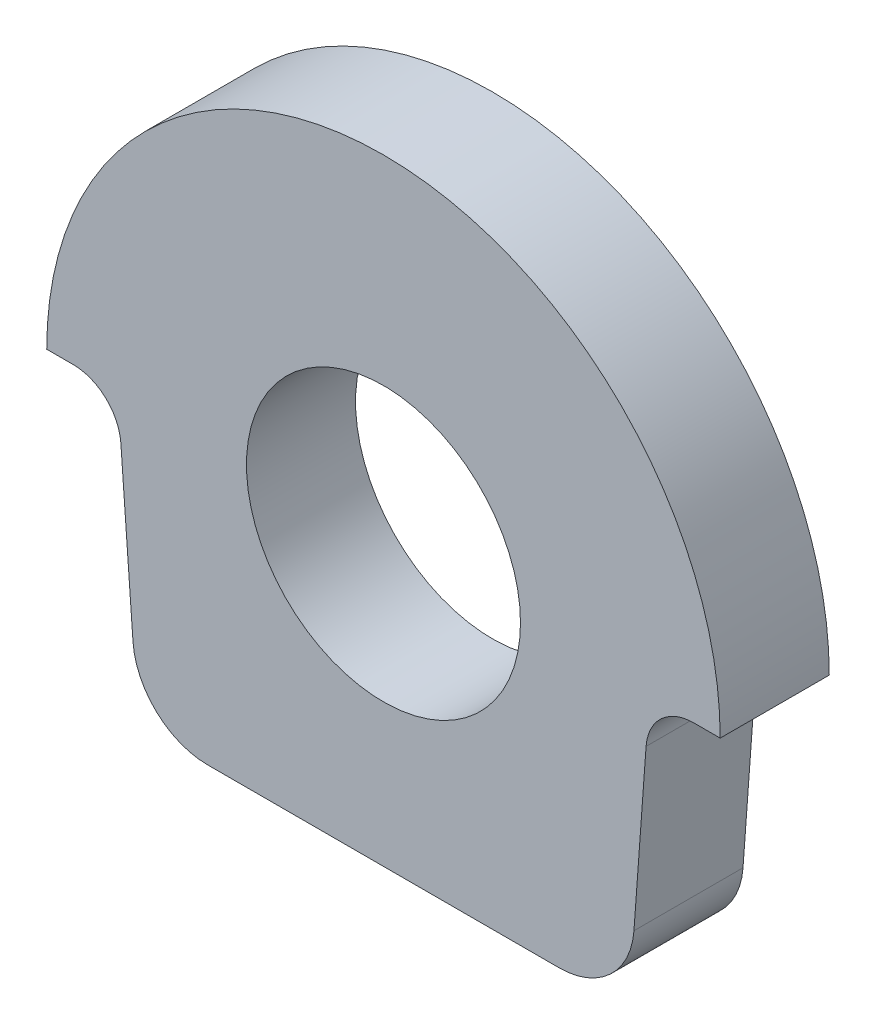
from build123d import *

# Parameters (mm, degrees)
ESQUISSE1_R      = 10.05
EXTRUSION1_DEPTH = 8


with BuildPart() as part:
    # Esquisse1 → Extrusion1 (new body)
    with BuildSketch(Plane.XY):
        with BuildLine():
            Line((-12.8877353, -20.5), (12.8877353, -20.5))
            ThreePointArc((12.8877353, -20.5), (16.632230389, -19.028493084), (18.37307078, -15.401366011))
            Line((18.37307078, -15.401366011), (19.262591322, -3.244585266))
            ThreePointArc((19.262591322, -3.244585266), (20.370398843, -0.936413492), (22.753259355, 0))
            Line((22.753259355, 0), (24.7, 0))
            ThreePointArc((24.7, 0), (0, 24.7), (-24.7, 0))
            Line((-24.7, 0), (-22.753259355, 0))
            ThreePointArc((-22.753259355, 0), (-20.370398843, -0.936413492), (-19.262591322, -3.244585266))
            Line((-19.262591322, -3.244585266), (-18.37307078, -15.401366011))
            ThreePointArc((-18.37307078, -15.401366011), (-16.632230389, -19.028493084), (-12.8877353, -20.5))
        make_face()
        Circle(ESQUISSE1_R, mode=Mode.SUBTRACT)
    extrude(amount=EXTRUSION1_DEPTH)


solid = part.part
